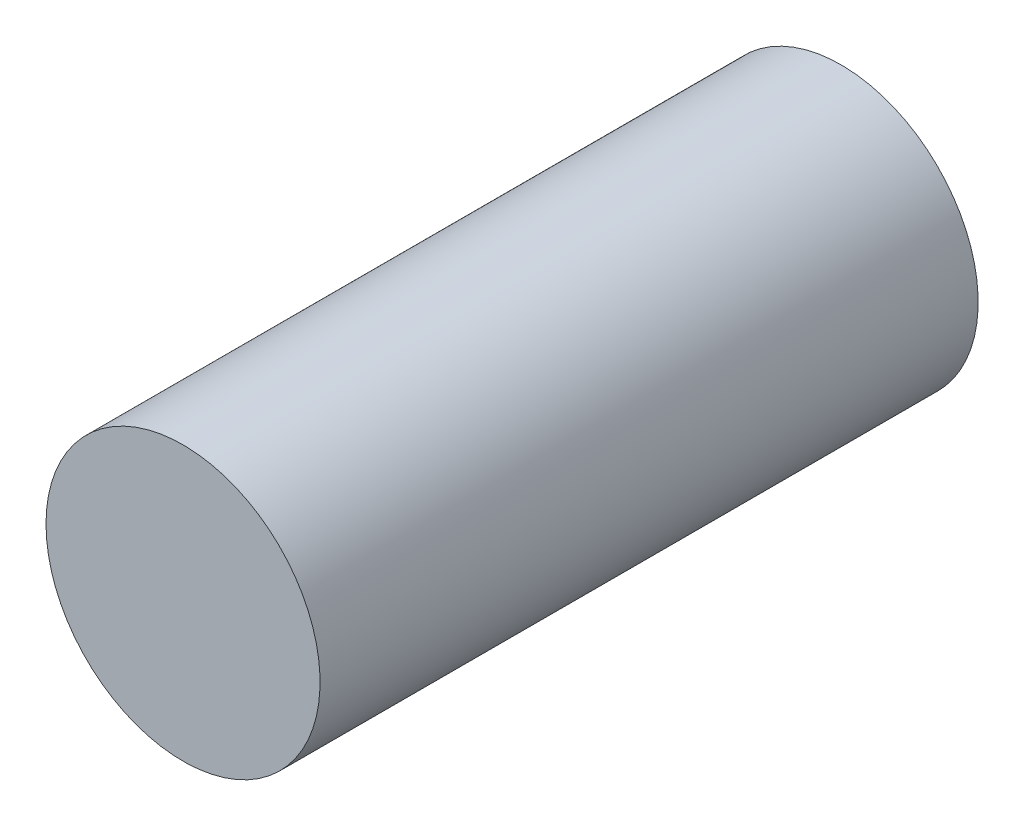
ISO-10303-21;
HEADER;
FILE_DESCRIPTION(('STEP AP214'),'2;1');
FILE_NAME('part.step','',(''),(''),'','','');
FILE_SCHEMA(('AUTOMOTIVE_DESIGN { 1 0 10303 214 1 1 1 1 }'));
ENDSEC;
DATA;
#1=APPLICATION_CONTEXT('core data for automotive mechanical design processes');
#2=APPLICATION_PROTOCOL_DEFINITION('international standard','automotive_design',2000,#1);
#3=PRODUCT_CONTEXT('',#1,'mechanical');
#4=PRODUCT('Part','Part','',(#3));
#5=PRODUCT_RELATED_PRODUCT_CATEGORY('part','',(#4));
#6=PRODUCT_DEFINITION_FORMATION('','',#4);
#7=PRODUCT_DEFINITION_CONTEXT('part definition',#1,'design');
#8=PRODUCT_DEFINITION('design','',#6,#7);
#9=PRODUCT_DEFINITION_SHAPE('','',#8);
#10=(LENGTH_UNIT() NAMED_UNIT(*) SI_UNIT(.MILLI.,.METRE.));
#11=(NAMED_UNIT(*) PLANE_ANGLE_UNIT() SI_UNIT($,.RADIAN.));
#12=(NAMED_UNIT(*) SI_UNIT($,.STERADIAN.) SOLID_ANGLE_UNIT());
#13=UNCERTAINTY_MEASURE_WITH_UNIT(LENGTH_MEASURE(1.E-05),#10,'distance_accuracy_value','');
#14=(GEOMETRIC_REPRESENTATION_CONTEXT(3) GLOBAL_UNCERTAINTY_ASSIGNED_CONTEXT((#13)) GLOBAL_UNIT_ASSIGNED_CONTEXT((#10,
#11,#12)) REPRESENTATION_CONTEXT('',''));
#15=CARTESIAN_POINT('',(0.,0.,0.));
#16=DIRECTION('',(0.,0.,1.));
#17=DIRECTION('',(1.,0.,0.));
#18=AXIS2_PLACEMENT_3D('',#15,#16,#17);
#19=CARTESIAN_POINT('',(0.,0.,353.06));
#20=DIRECTION('',(0.,0.,-1.));
#21=DIRECTION('',(-1.,0.,0.));
#22=AXIS2_PLACEMENT_3D('',#19,#20,#21);
#23=CYLINDRICAL_SURFACE('',#22,73.5134589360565);
#24=CARTESIAN_POINT('',(0.,0.,353.06));
#25=DIRECTION('',(0.,0.,1.));
#26=DIRECTION('',(1.,0.,0.));
#27=AXIS2_PLACEMENT_3D('',#24,#25,#26);
#28=CIRCLE('',#27,73.5134589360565);
#29=CARTESIAN_POINT('',(-73.5134589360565,0.,353.06));
#30=VERTEX_POINT('',#29);
#31=EDGE_CURVE('E10',#30,#30,#28,.T.);
#32=CARTESIAN_POINT('',(0.,0.,0.));
#33=DIRECTION('',(0.,0.,1.));
#34=DIRECTION('',(1.,0.,0.));
#35=AXIS2_PLACEMENT_3D('',#32,#33,#34);
#36=CIRCLE('',#35,73.5134589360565);
#37=CARTESIAN_POINT('',(-73.5134589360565,0.,0.));
#38=VERTEX_POINT('',#37);
#39=EDGE_CURVE('E34',#38,#38,#36,.T.);
#40=CARTESIAN_POINT('',(-73.5134589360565,0.,353.06));
#41=CARTESIAN_POINT('',(-73.5134589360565,0.,349.382291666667));
#42=CARTESIAN_POINT('',(-73.5134589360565,0.,345.704583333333));
#43=CARTESIAN_POINT('',(-73.5134589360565,0.,338.349166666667));
#44=CARTESIAN_POINT('',(-73.5134589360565,0.,334.671458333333));
#45=CARTESIAN_POINT('',(-73.5134589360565,0.,327.316041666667));
#46=CARTESIAN_POINT('',(-73.5134589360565,0.,323.638333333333));
#47=CARTESIAN_POINT('',(-73.5134589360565,0.,316.282916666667));
#48=CARTESIAN_POINT('',(-73.5134589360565,0.,312.605208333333));
#49=CARTESIAN_POINT('',(-73.5134589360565,0.,305.249791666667));
#50=CARTESIAN_POINT('',(-73.5134589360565,0.,301.572083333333));
#51=CARTESIAN_POINT('',(-73.5134589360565,0.,294.216666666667));
#52=CARTESIAN_POINT('',(-73.5134589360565,0.,290.538958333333));
#53=CARTESIAN_POINT('',(-73.5134589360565,0.,283.183541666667));
#54=CARTESIAN_POINT('',(-73.5134589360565,0.,279.505833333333));
#55=CARTESIAN_POINT('',(-73.5134589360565,0.,272.150416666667));
#56=CARTESIAN_POINT('',(-73.5134589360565,0.,268.472708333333));
#57=CARTESIAN_POINT('',(-73.5134589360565,0.,261.117291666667));
#58=CARTESIAN_POINT('',(-73.5134589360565,0.,257.439583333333));
#59=CARTESIAN_POINT('',(-73.5134589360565,0.,250.084166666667));
#60=CARTESIAN_POINT('',(-73.5134589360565,0.,246.406458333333));
#61=CARTESIAN_POINT('',(-73.5134589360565,0.,239.051041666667));
#62=CARTESIAN_POINT('',(-73.5134589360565,0.,235.373333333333));
#63=CARTESIAN_POINT('',(-73.5134589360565,0.,228.017916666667));
#64=CARTESIAN_POINT('',(-73.5134589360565,0.,224.340208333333));
#65=CARTESIAN_POINT('',(-73.5134589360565,0.,216.984791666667));
#66=CARTESIAN_POINT('',(-73.5134589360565,0.,213.307083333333));
#67=CARTESIAN_POINT('',(-73.5134589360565,0.,205.951666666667));
#68=CARTESIAN_POINT('',(-73.5134589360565,0.,202.273958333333));
#69=CARTESIAN_POINT('',(-73.5134589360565,0.,194.918541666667));
#70=CARTESIAN_POINT('',(-73.5134589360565,0.,191.240833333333));
#71=CARTESIAN_POINT('',(-73.5134589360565,0.,183.885416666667));
#72=CARTESIAN_POINT('',(-73.5134589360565,0.,180.207708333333));
#73=CARTESIAN_POINT('',(-73.5134589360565,0.,172.852291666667));
#74=CARTESIAN_POINT('',(-73.5134589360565,0.,169.174583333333));
#75=CARTESIAN_POINT('',(-73.5134589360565,0.,161.819166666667));
#76=CARTESIAN_POINT('',(-73.5134589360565,0.,158.141458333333));
#77=CARTESIAN_POINT('',(-73.5134589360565,0.,150.786041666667));
#78=CARTESIAN_POINT('',(-73.5134589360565,0.,147.108333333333));
#79=CARTESIAN_POINT('',(-73.5134589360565,0.,139.752916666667));
#80=CARTESIAN_POINT('',(-73.5134589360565,0.,136.075208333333));
#81=CARTESIAN_POINT('',(-73.5134589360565,0.,128.719791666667));
#82=CARTESIAN_POINT('',(-73.5134589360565,0.,125.042083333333));
#83=CARTESIAN_POINT('',(-73.5134589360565,0.,117.686666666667));
#84=CARTESIAN_POINT('',(-73.5134589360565,0.,114.008958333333));
#85=CARTESIAN_POINT('',(-73.5134589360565,0.,106.653541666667));
#86=CARTESIAN_POINT('',(-73.5134589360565,0.,102.975833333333));
#87=CARTESIAN_POINT('',(-73.5134589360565,0.,95.6204166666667));
#88=CARTESIAN_POINT('',(-73.5134589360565,0.,91.9427083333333));
#89=CARTESIAN_POINT('',(-73.5134589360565,0.,84.5872916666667));
#90=CARTESIAN_POINT('',(-73.5134589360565,0.,80.9095833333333));
#91=CARTESIAN_POINT('',(-73.5134589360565,0.,73.5541666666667));
#92=CARTESIAN_POINT('',(-73.5134589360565,0.,69.8764583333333));
#93=CARTESIAN_POINT('',(-73.5134589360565,0.,62.5210416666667));
#94=CARTESIAN_POINT('',(-73.5134589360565,0.,58.8433333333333));
#95=CARTESIAN_POINT('',(-73.5134589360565,0.,51.4879166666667));
#96=CARTESIAN_POINT('',(-73.5134589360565,0.,47.8102083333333));
#97=CARTESIAN_POINT('',(-73.5134589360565,0.,40.4547916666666));
#98=CARTESIAN_POINT('',(-73.5134589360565,0.,36.7770833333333));
#99=CARTESIAN_POINT('',(-73.5134589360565,0.,29.4216666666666));
#100=CARTESIAN_POINT('',(-73.5134589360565,0.,25.7439583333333));
#101=CARTESIAN_POINT('',(-73.5134589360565,0.,18.3885416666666));
#102=CARTESIAN_POINT('',(-73.5134589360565,0.,14.7108333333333));
#103=CARTESIAN_POINT('',(-73.5134589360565,0.,7.35541666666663));
#104=CARTESIAN_POINT('',(-73.5134589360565,0.,3.67770833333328));
#105=CARTESIAN_POINT('',(-73.5134589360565,0.,0.));
#106=B_SPLINE_CURVE_WITH_KNOTS('',3,(#40,#41,#42,#43,#44,#45,#46,#47,#48,#49,#50,#51,#52,#53,
#54,#55,#56,#57,#58,#59,#60,#61,#62,#63,#64,#65,#66,#67,#68,#69,#70,#71,#72,#73,#74,#75,#76,#77,
#78,#79,#80,#81,#82,#83,#84,#85,#86,#87,#88,#89,#90,#91,#92,#93,#94,#95,#96,#97,#98,#99,#100,
#101,#102,#103,#104,#105),.UNSPECIFIED.,.F.,.F.,(4,2,2,2,2,2,2,2,2,2,2,2,2,2,2,2,2,2,2,2,2,2,2,
2,2,2,2,2,2,2,2,2,4),(0.,11.033125,22.0662500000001,33.099375,44.1325000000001,55.165625,
66.1987500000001,77.2318750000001,88.2650000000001,99.2981250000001,110.33125,121.364375,
132.3975,143.430625,154.46375,165.496875,176.53,187.563125,198.59625,209.629375,220.6625,
231.695625,242.72875,253.761875,264.795,275.828125,286.86125,297.894375,308.9275,319.960625,
330.99375,342.026875,353.06),.UNSPECIFIED.);
#107=EDGE_CURVE('BSEAM31',#30,#38,#106,.T.);
#108=ORIENTED_EDGE('',*,*,#31,.F.);
#109=ORIENTED_EDGE('',*,*,#39,.T.);
#110=ORIENTED_EDGE('',*,*,#107,.T.);
#111=ORIENTED_EDGE('',*,*,#107,.F.);
#112=EDGE_LOOP('',(#108,#110,#109,#111));
#113=FACE_BOUND('',#112,.T.);
#114=ADVANCED_FACE('F31',(#113),#23,.T.);
#115=CARTESIAN_POINT('',(0.,0.,353.06));
#116=DIRECTION('',(0.,0.,1.));
#117=DIRECTION('',(1.,0.,0.));
#118=AXIS2_PLACEMENT_3D('',#115,#116,#117);
#119=PLANE('',#118);
#120=ORIENTED_EDGE('',*,*,#31,.T.);
#121=EDGE_LOOP('',(#120));
#122=FACE_BOUND('',#121,.T.);
#123=ADVANCED_FACE('F46',(#122),#119,.T.);
#124=CARTESIAN_POINT('',(0.,0.,0.));
#125=DIRECTION('',(0.,0.,1.));
#126=DIRECTION('',(1.,0.,0.));
#127=AXIS2_PLACEMENT_3D('',#124,#125,#126);
#128=PLANE('',#127);
#129=ORIENTED_EDGE('',*,*,#39,.F.);
#130=EDGE_LOOP('',(#129));
#131=FACE_BOUND('',#130,.T.);
#132=ADVANCED_FACE('F44',(#131),#128,.F.);
#133=CLOSED_SHELL('',(#114,#123,#132));
#134=MANIFOLD_SOLID_BREP('B2',#133);
#135=ADVANCED_BREP_SHAPE_REPRESENTATION('',(#18,#134),#14);
#136=SHAPE_DEFINITION_REPRESENTATION(#9,#135);
ENDSEC;
END-ISO-10303-21;
